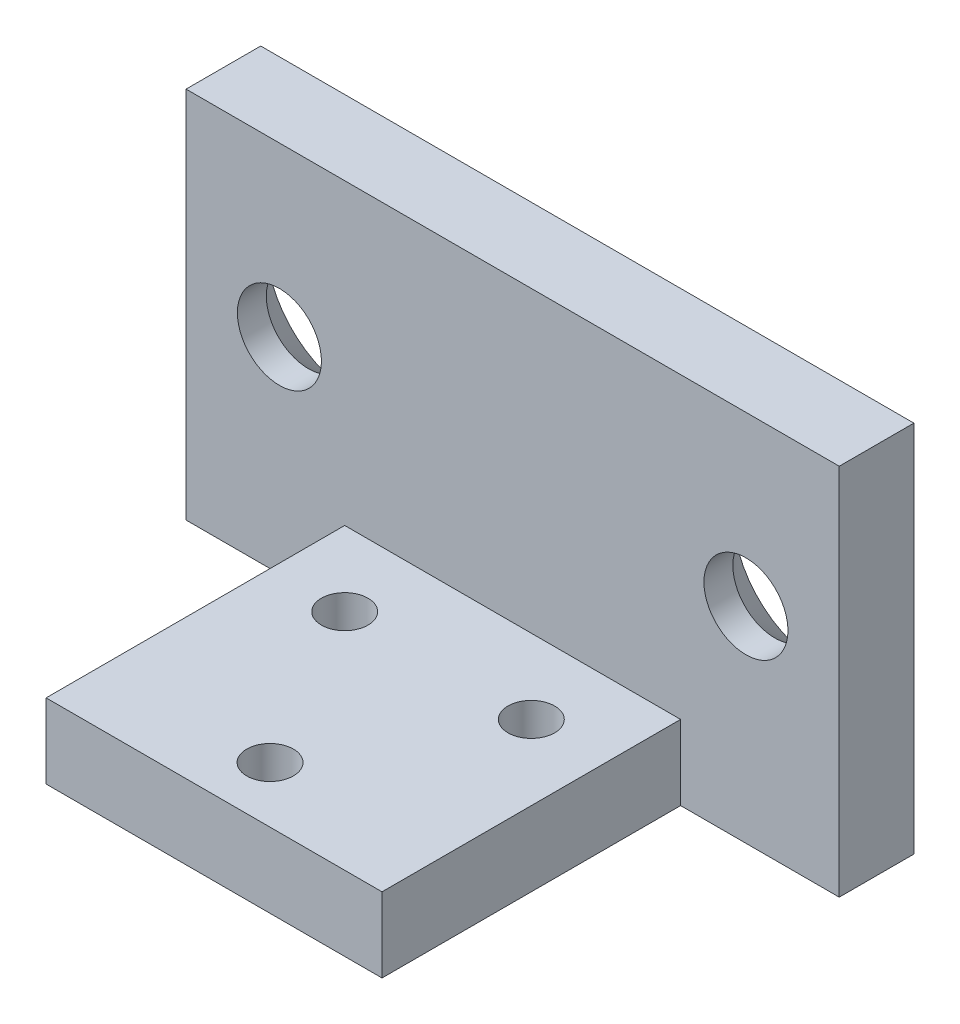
from build123d import *

# Parameters (mm, degrees)
ESQUISSE1_W                                    = 35
ESQUISSE1_H                                    = 20
EXTRUSION1_DEPTH                               = 4
ESQUISSE2_W                                    = 18
ESQUISSE2_H                                    = 4
EXTRUSION2_DEPTH                               = 16
FRAISAGE_POUR_VIS_T_TE_FRAIS_E_M41_D           = 4.5
FRAISAGE_POUR_VIS_T_TE_FRAIS_E_M41_CSINK_D     = 9.4
FRAISAGE_POUR_VIS_T_TE_FRAIS_E_M41_CSINK_ANGLE = 90
TROU_TARAUD_M3X0_51_D                          = 2.5


with BuildPart() as part:
    # Esquisse1 → Extrusion1 (new body)
    with BuildSketch(Plane.XY):
        with Locations((17.5, 10)):
            Rectangle(ESQUISSE1_W, ESQUISSE1_H)
    extrude(amount=EXTRUSION1_DEPTH)

    # Esquisse2 → Extrusion2 (add)
    with BuildSketch(Plane.XY.offset(4)):
        with Locations((17.5, 2)):
            Rectangle(ESQUISSE2_W, ESQUISSE2_H)
    extrude(amount=EXTRUSION2_DEPTH)

    # Fraisage pour vis _ t_te frais_e M41 (through all)
    with Locations(Plane(origin=(0, 0, 0), x_dir=(-1, 0, 0), z_dir=(0, 0, -1))):
        with Locations((-5, 11), (-30, 11)):
            CounterSinkHole(FRAISAGE_POUR_VIS_T_TE_FRAIS_E_M41_D / 2, FRAISAGE_POUR_VIS_T_TE_FRAIS_E_M41_CSINK_D / 2, counter_sink_angle=FRAISAGE_POUR_VIS_T_TE_FRAIS_E_M41_CSINK_ANGLE)

    # Trou taraud_ M3x0.51 (through all)
    with Locations(Plane(origin=(0, 4, 0), x_dir=(-1, 0, 0), z_dir=(0, 1, 0))):
        with Locations((-12.5, 8), (-22.5, 8), (-17.5, 17)):
            Hole(TROU_TARAUD_M3X0_51_D / 2)


solid = part.part
